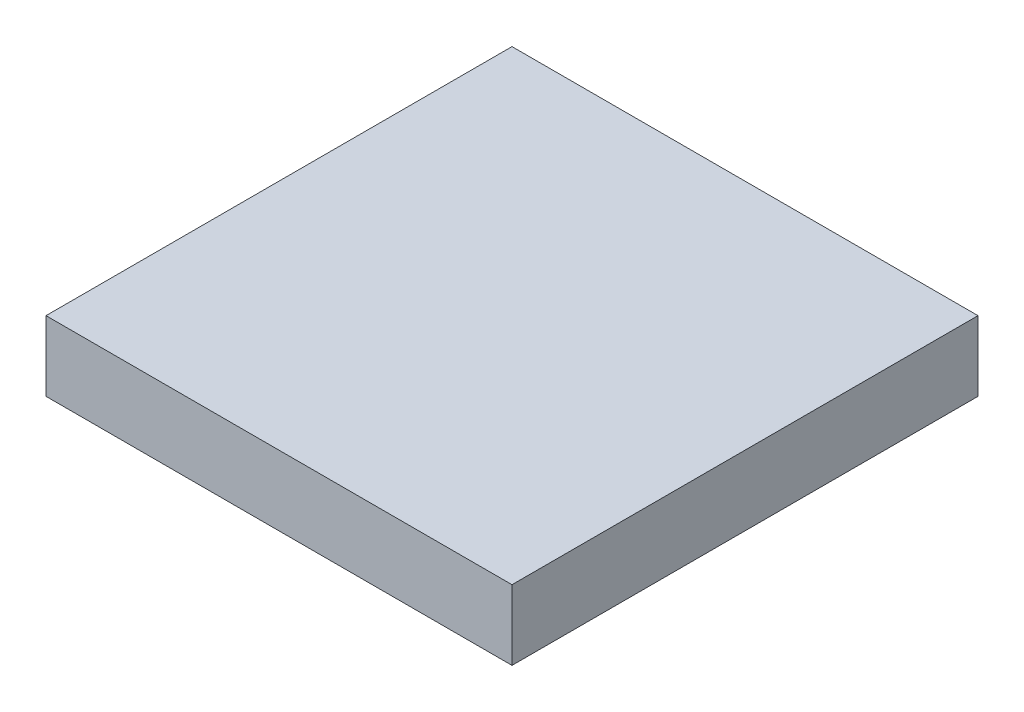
ISO-10303-21;
HEADER;
FILE_DESCRIPTION(('STEP AP214'),'2;1');
FILE_NAME('part.step','',(''),(''),'','','');
FILE_SCHEMA(('AUTOMOTIVE_DESIGN { 1 0 10303 214 1 1 1 1 }'));
ENDSEC;
DATA;
#1=APPLICATION_CONTEXT('core data for automotive mechanical design processes');
#2=APPLICATION_PROTOCOL_DEFINITION('international standard','automotive_design',2000,#1);
#3=PRODUCT_CONTEXT('',#1,'mechanical');
#4=PRODUCT('Part','Part','',(#3));
#5=PRODUCT_RELATED_PRODUCT_CATEGORY('part','',(#4));
#6=PRODUCT_DEFINITION_FORMATION('','',#4);
#7=PRODUCT_DEFINITION_CONTEXT('part definition',#1,'design');
#8=PRODUCT_DEFINITION('design','',#6,#7);
#9=PRODUCT_DEFINITION_SHAPE('','',#8);
#10=(LENGTH_UNIT() NAMED_UNIT(*) SI_UNIT(.MILLI.,.METRE.));
#11=(NAMED_UNIT(*) PLANE_ANGLE_UNIT() SI_UNIT($,.RADIAN.));
#12=(NAMED_UNIT(*) SI_UNIT($,.STERADIAN.) SOLID_ANGLE_UNIT());
#13=UNCERTAINTY_MEASURE_WITH_UNIT(LENGTH_MEASURE(1.E-05),#10,'distance_accuracy_value','');
#14=(GEOMETRIC_REPRESENTATION_CONTEXT(3) GLOBAL_UNCERTAINTY_ASSIGNED_CONTEXT((#13)) GLOBAL_UNIT_ASSIGNED_CONTEXT((#10,
#11,#12)) REPRESENTATION_CONTEXT('',''));
#15=CARTESIAN_POINT('',(0.,0.,0.));
#16=DIRECTION('',(0.,0.,1.));
#17=DIRECTION('',(1.,0.,0.));
#18=AXIS2_PLACEMENT_3D('',#15,#16,#17);
#19=CARTESIAN_POINT('',(31.5,-0.01,-5.));
#20=DIRECTION('',(-1.,0.,0.));
#21=DIRECTION('',(0.,0.,1.));
#22=AXIS2_PLACEMENT_3D('',#19,#20,#21);
#23=PLANE('',#22);
#24=DIRECTION('',(0.,1.,0.));
#25=VECTOR('',#24,1.);
#26=CARTESIAN_POINT('',(31.5,-0.01,-5.));
#27=LINE('',#26,#25);
#28=CARTESIAN_POINT('',(31.5,0.,-5.));
#29=VERTEX_POINT('',#28);
#30=CARTESIAN_POINT('',(31.5,1.5,-5.));
#31=VERTEX_POINT('',#30);
#32=EDGE_CURVE('E11',#29,#31,#27,.T.);
#33=ORIENTED_EDGE('',*,*,#32,.T.);
#34=DIRECTION('',(0.,0.,1.));
#35=VECTOR('',#34,1.);
#36=CARTESIAN_POINT('',(31.5,1.5,0.));
#37=LINE('',#36,#35);
#38=CARTESIAN_POINT('',(31.5,1.5,5.));
#39=VERTEX_POINT('',#38);
#40=EDGE_CURVE('E77',#31,#39,#37,.T.);
#41=ORIENTED_EDGE('',*,*,#40,.T.);
#42=DIRECTION('',(0.,-1.,0.));
#43=VECTOR('',#42,1.);
#44=CARTESIAN_POINT('',(31.5,-0.01,5.));
#45=LINE('',#44,#43);
#46=CARTESIAN_POINT('',(31.5,0.,5.));
#47=VERTEX_POINT('',#46);
#48=EDGE_CURVE('E38',#39,#47,#45,.T.);
#49=ORIENTED_EDGE('',*,*,#48,.T.);
#50=DIRECTION('',(0.,0.,1.));
#51=VECTOR('',#50,1.);
#52=CARTESIAN_POINT('',(31.5,0.,0.));
#53=LINE('',#52,#51);
#54=EDGE_CURVE('E56',#29,#47,#53,.T.);
#55=ORIENTED_EDGE('',*,*,#54,.F.);
#56=EDGE_LOOP('',(#33,#41,#49,#55));
#57=FACE_BOUND('',#56,.T.);
#58=ADVANCED_FACE('F35',(#57),#23,.F.);
#59=CARTESIAN_POINT('',(31.5,-0.01,5.));
#60=DIRECTION('',(0.,0.,1.));
#61=DIRECTION('',(1.,0.,0.));
#62=AXIS2_PLACEMENT_3D('',#59,#60,#61);
#63=PLANE('',#62);
#64=DIRECTION('',(0.,1.,0.));
#65=VECTOR('',#64,1.);
#66=CARTESIAN_POINT('',(21.5,-0.01,5.));
#67=LINE('',#66,#65);
#68=CARTESIAN_POINT('',(21.5,0.,5.));
#69=VERTEX_POINT('',#68);
#70=CARTESIAN_POINT('',(21.5,1.5,5.));
#71=VERTEX_POINT('',#70);
#72=EDGE_CURVE('E97',#69,#71,#67,.T.);
#73=ORIENTED_EDGE('',*,*,#72,.F.);
#74=DIRECTION('',(1.,0.,0.));
#75=VECTOR('',#74,1.);
#76=CARTESIAN_POINT('',(0.,0.,5.));
#77=LINE('',#76,#75);
#78=EDGE_CURVE('E99',#69,#47,#77,.T.);
#79=ORIENTED_EDGE('',*,*,#78,.T.);
#80=ORIENTED_EDGE('',*,*,#48,.F.);
#81=DIRECTION('',(1.,0.,0.));
#82=VECTOR('',#81,1.);
#83=CARTESIAN_POINT('',(0.,1.5,5.));
#84=LINE('',#83,#82);
#85=EDGE_CURVE('E83',#71,#39,#84,.T.);
#86=ORIENTED_EDGE('',*,*,#85,.F.);
#87=EDGE_LOOP('',(#73,#79,#80,#86));
#88=FACE_BOUND('',#87,.T.);
#89=ADVANCED_FACE('F108',(#88),#63,.T.);
#90=CARTESIAN_POINT('',(31.5,-0.01,-5.));
#91=DIRECTION('',(0.,0.,-1.));
#92=DIRECTION('',(-1.,0.,0.));
#93=AXIS2_PLACEMENT_3D('',#90,#91,#92);
#94=PLANE('',#93);
#95=ORIENTED_EDGE('',*,*,#32,.F.);
#96=DIRECTION('',(-1.,0.,0.));
#97=VECTOR('',#96,1.);
#98=CARTESIAN_POINT('',(0.,0.,-4.99999999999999));
#99=LINE('',#98,#97);
#100=CARTESIAN_POINT('',(21.5,0.,-5.));
#101=VERTEX_POINT('',#100);
#102=EDGE_CURVE('E101',#29,#101,#99,.T.);
#103=ORIENTED_EDGE('',*,*,#102,.T.);
#104=DIRECTION('',(0.,1.,0.));
#105=VECTOR('',#104,1.);
#106=CARTESIAN_POINT('',(21.5,-0.01,-5.));
#107=LINE('',#106,#105);
#108=CARTESIAN_POINT('',(21.5,1.5,-5.));
#109=VERTEX_POINT('',#108);
#110=EDGE_CURVE('E91',#101,#109,#107,.T.);
#111=ORIENTED_EDGE('',*,*,#110,.T.);
#112=DIRECTION('',(-1.,0.,0.));
#113=VECTOR('',#112,1.);
#114=CARTESIAN_POINT('',(0.,1.5,-4.99999999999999));
#115=LINE('',#114,#113);
#116=EDGE_CURVE('E80',#31,#109,#115,.T.);
#117=ORIENTED_EDGE('',*,*,#116,.F.);
#118=EDGE_LOOP('',(#95,#103,#111,#117));
#119=FACE_BOUND('',#118,.T.);
#120=ADVANCED_FACE('F90',(#119),#94,.T.);
#121=CARTESIAN_POINT('',(21.5,-0.01,5.));
#122=DIRECTION('',(-1.,0.,0.));
#123=DIRECTION('',(0.,0.,1.));
#124=AXIS2_PLACEMENT_3D('',#121,#122,#123);
#125=PLANE('',#124);
#126=ORIENTED_EDGE('',*,*,#110,.F.);
#127=DIRECTION('',(0.,0.,1.));
#128=VECTOR('',#127,1.);
#129=CARTESIAN_POINT('',(21.5,0.,0.));
#130=LINE('',#129,#128);
#131=EDGE_CURVE('E49',#101,#69,#130,.T.);
#132=ORIENTED_EDGE('',*,*,#131,.T.);
#133=ORIENTED_EDGE('',*,*,#72,.T.);
#134=DIRECTION('',(0.,0.,1.));
#135=VECTOR('',#134,1.);
#136=CARTESIAN_POINT('',(21.5,1.5,0.));
#137=LINE('',#136,#135);
#138=EDGE_CURVE('E85',#109,#71,#137,.T.);
#139=ORIENTED_EDGE('',*,*,#138,.F.);
#140=EDGE_LOOP('',(#126,#132,#133,#139));
#141=FACE_BOUND('',#140,.T.);
#142=ADVANCED_FACE('F107',(#141),#125,.T.);
#143=CARTESIAN_POINT('',(0.,0.,0.));
#144=DIRECTION('',(0.,1.,0.));
#145=DIRECTION('',(0.,0.,1.));
#146=AXIS2_PLACEMENT_3D('',#143,#144,#145);
#147=PLANE('',#146);
#148=ORIENTED_EDGE('',*,*,#131,.F.);
#149=ORIENTED_EDGE('',*,*,#102,.F.);
#150=ORIENTED_EDGE('',*,*,#54,.T.);
#151=ORIENTED_EDGE('',*,*,#78,.F.);
#152=EDGE_LOOP('',(#148,#149,#150,#151));
#153=FACE_BOUND('',#152,.T.);
#154=ADVANCED_FACE('F117',(#153),#147,.F.);
#155=CARTESIAN_POINT('',(0.,1.5,0.));
#156=DIRECTION('',(0.,1.,0.));
#157=DIRECTION('',(0.,0.,1.));
#158=AXIS2_PLACEMENT_3D('',#155,#156,#157);
#159=PLANE('',#158);
#160=ORIENTED_EDGE('',*,*,#116,.T.);
#161=ORIENTED_EDGE('',*,*,#138,.T.);
#162=ORIENTED_EDGE('',*,*,#85,.T.);
#163=ORIENTED_EDGE('',*,*,#40,.F.);
#164=EDGE_LOOP('',(#160,#161,#162,#163));
#165=FACE_BOUND('',#164,.T.);
#166=ADVANCED_FACE('F78',(#165),#159,.T.);
#167=CLOSED_SHELL('',(#58,#89,#120,#142,#154,#166));
#168=MANIFOLD_SOLID_BREP('B2',#167);
#169=ADVANCED_BREP_SHAPE_REPRESENTATION('',(#18,#168),#14);
#170=SHAPE_DEFINITION_REPRESENTATION(#9,#169);
ENDSEC;
END-ISO-10303-21;
